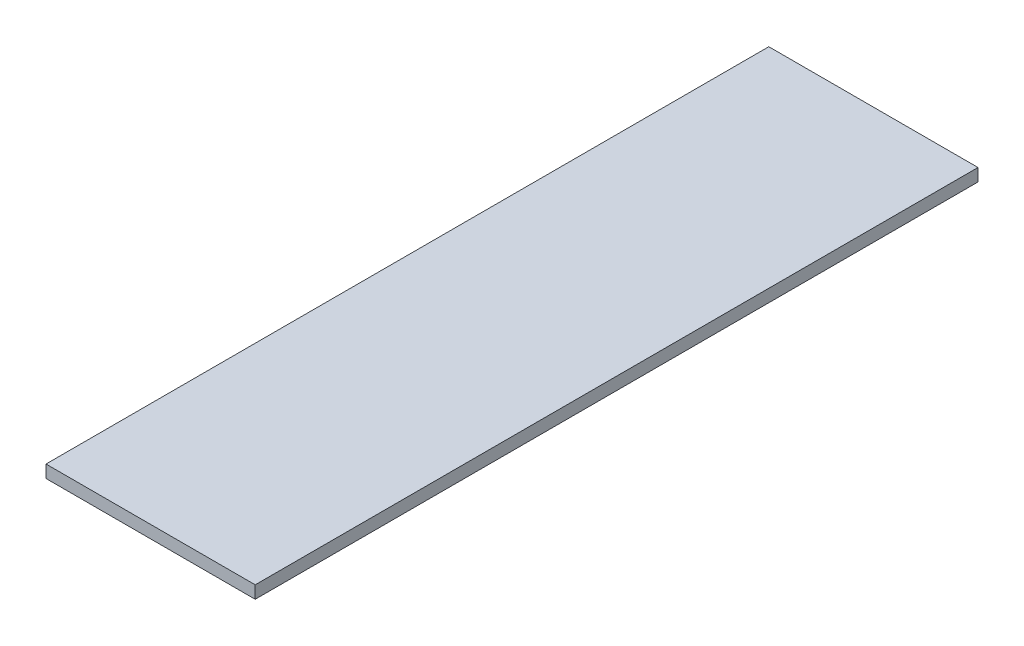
from build123d import *

# Parameters (mm, degrees)
SKETCH1_W           = 200
SKETCH1_H           = 691
BOSS_EXTRUDE1_DEPTH = 12


with BuildPart() as part:
    # Sketch1 → Boss-Extrude1 (new body)
    with BuildSketch(Plane(origin=(0, 0, 0), x_dir=(1, 0, 0), z_dir=(0, 1, 0))):
        Rectangle(SKETCH1_W, SKETCH1_H)
    extrude(amount=BOSS_EXTRUDE1_DEPTH)


solid = part.part
